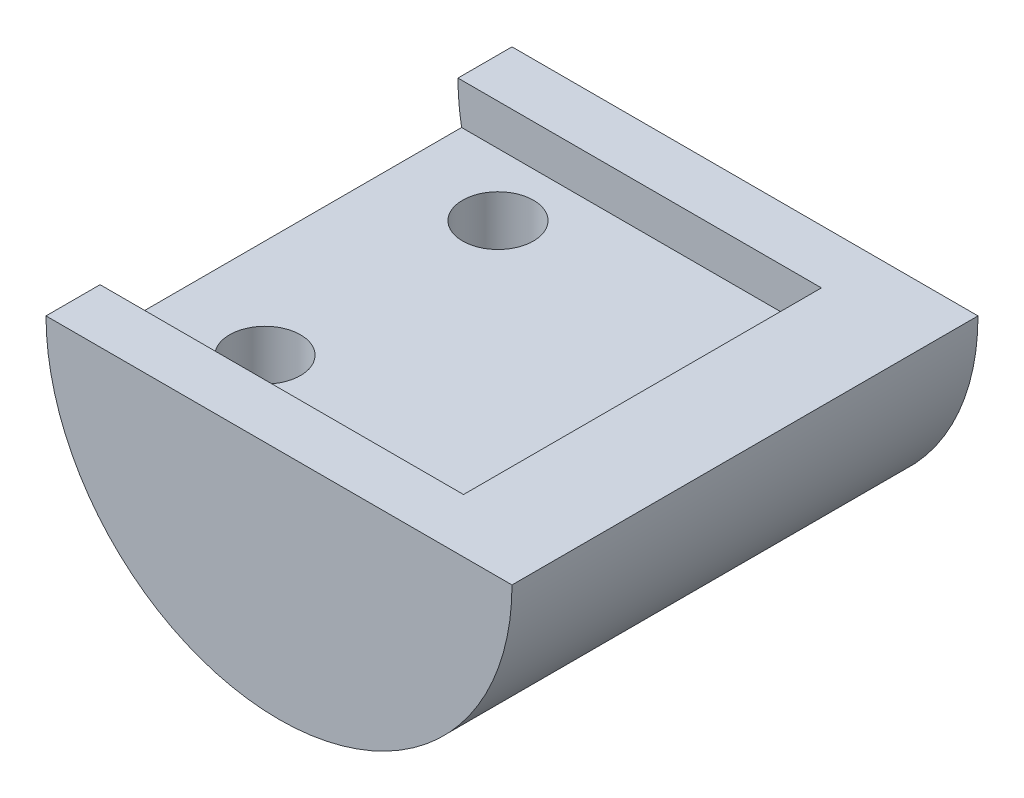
ISO-10303-21;
HEADER;
FILE_DESCRIPTION(('STEP AP214'),'2;1');
FILE_NAME('part.step','',(''),(''),'','','');
FILE_SCHEMA(('AUTOMOTIVE_DESIGN { 1 0 10303 214 1 1 1 1 }'));
ENDSEC;
DATA;
#1=APPLICATION_CONTEXT('core data for automotive mechanical design processes');
#2=APPLICATION_PROTOCOL_DEFINITION('international standard','automotive_design',2000,#1);
#3=PRODUCT_CONTEXT('',#1,'mechanical');
#4=PRODUCT('Part','Part','',(#3));
#5=PRODUCT_RELATED_PRODUCT_CATEGORY('part','',(#4));
#6=PRODUCT_DEFINITION_FORMATION('','',#4);
#7=PRODUCT_DEFINITION_CONTEXT('part definition',#1,'design');
#8=PRODUCT_DEFINITION('design','',#6,#7);
#9=PRODUCT_DEFINITION_SHAPE('','',#8);
#10=(LENGTH_UNIT() NAMED_UNIT(*) SI_UNIT(.MILLI.,.METRE.));
#11=(NAMED_UNIT(*) PLANE_ANGLE_UNIT() SI_UNIT($,.RADIAN.));
#12=(NAMED_UNIT(*) SI_UNIT($,.STERADIAN.) SOLID_ANGLE_UNIT());
#13=UNCERTAINTY_MEASURE_WITH_UNIT(LENGTH_MEASURE(1.E-05),#10,'distance_accuracy_value','');
#14=(GEOMETRIC_REPRESENTATION_CONTEXT(3) GLOBAL_UNCERTAINTY_ASSIGNED_CONTEXT((#13)) GLOBAL_UNIT_ASSIGNED_CONTEXT((#10,
#11,#12)) REPRESENTATION_CONTEXT('',''));
#15=CARTESIAN_POINT('',(0.,0.,0.));
#16=DIRECTION('',(0.,0.,1.));
#17=DIRECTION('',(1.,0.,0.));
#18=AXIS2_PLACEMENT_3D('',#15,#16,#17);
#19=CARTESIAN_POINT('',(0.,0.,-15.875));
#20=DIRECTION('',(0.,0.,1.));
#21=DIRECTION('',(1.,0.,0.));
#22=AXIS2_PLACEMENT_3D('',#19,#20,#21);
#23=CYLINDRICAL_SURFACE('',#22,15.875);
#24=CARTESIAN_POINT('',(-8.89,-13.1523201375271,-5.5245));
#25=CARTESIAN_POINT('',(-9.05972872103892,-13.0375901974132,-5.52450107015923));
#26=CARTESIAN_POINT('',(-9.22727176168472,-12.9195123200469,-5.54240014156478));
#27=CARTESIAN_POINT('',(-9.55334468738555,-12.6803108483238,-5.61147256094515));
#28=CARTESIAN_POINT('',(-9.71185841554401,-12.5591823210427,-5.66270363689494));
#29=CARTESIAN_POINT('',(-10.0143117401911,-12.3193368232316,-5.79611020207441));
#30=CARTESIAN_POINT('',(-10.1583841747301,-12.2006078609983,-5.87796282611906));
#31=CARTESIAN_POINT('',(-10.4298675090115,-11.9693402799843,-6.07224436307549));
#32=CARTESIAN_POINT('',(-10.5573071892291,-11.8567911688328,-6.18461939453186));
#33=CARTESIAN_POINT('',(-10.7530654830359,-11.678988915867,-6.39951330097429));
#34=CARTESIAN_POINT('',(-10.8272630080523,-11.6101150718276,-6.493706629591));
#35=CARTESIAN_POINT('',(-10.9630676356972,-11.4819612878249,-6.69661009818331));
#36=CARTESIAN_POINT('',(-11.0246956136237,-11.4226654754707,-6.80529566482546));
#37=CARTESIAN_POINT('',(-11.1207475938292,-11.3290833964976,-7.01205863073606));
#38=CARTESIAN_POINT('',(-11.1581678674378,-11.2921600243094,-7.10753639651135));
#39=CARTESIAN_POINT('',(-11.2211762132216,-11.2295508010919,-7.30585145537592));
#40=CARTESIAN_POINT('',(-11.2467738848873,-11.2038558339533,-7.40868269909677));
#41=CARTESIAN_POINT('',(-11.2844602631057,-11.1659002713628,-7.62011964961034));
#42=CARTESIAN_POINT('',(-11.296444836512,-11.1537432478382,-7.72876329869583));
#43=CARTESIAN_POINT('',(-11.305452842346,-11.144613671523,-7.94729251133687));
#44=CARTESIAN_POINT('',(-11.3024834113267,-11.1476338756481,-8.05717745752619));
#45=CARTESIAN_POINT('',(-11.2831215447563,-11.1672257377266,-8.2612130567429));
#46=CARTESIAN_POINT('',(-11.2683560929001,-11.1821545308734,-8.35568907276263));
#47=CARTESIAN_POINT('',(-11.2284415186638,-11.2222333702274,-8.54014210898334));
#48=CARTESIAN_POINT('',(-11.2032877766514,-11.2473879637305,-8.63011710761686));
#49=CARTESIAN_POINT('',(-11.1341284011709,-11.3159121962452,-8.83269477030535));
#50=CARTESIAN_POINT('',(-11.0866428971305,-11.3625520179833,-8.94299874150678));
#51=CARTESIAN_POINT('',(-10.9787373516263,-11.4668477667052,-9.15141387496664));
#52=CARTESIAN_POINT('',(-10.918290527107,-11.5245264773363,-9.2494991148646));
#53=CARTESIAN_POINT('',(-10.7642260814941,-11.6688325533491,-9.46489709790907));
#54=CARTESIAN_POINT('',(-10.6663734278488,-11.7585639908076,-9.57708875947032));
#55=CARTESIAN_POINT('',(-10.4562025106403,-11.9458509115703,-9.77892577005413));
#56=CARTESIAN_POINT('',(-10.3438713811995,-12.0434133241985,-9.86855085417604));
#57=CARTESIAN_POINT('',(-10.1050171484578,-12.2445563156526,-10.027309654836));
#58=CARTESIAN_POINT('',(-9.9782321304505,-12.3482228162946,-10.0959383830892));
#59=CARTESIAN_POINT('',(-9.71507202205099,-12.5563203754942,-10.2095856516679));
#60=CARTESIAN_POINT('',(-9.57869442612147,-12.6607516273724,-10.2545979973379));
#61=CARTESIAN_POINT('',(-9.27611959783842,-12.8844876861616,-10.3252491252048));
#62=CARTESIAN_POINT('',(-9.10865922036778,-13.0034764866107,-10.3465953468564));
#63=CARTESIAN_POINT('',(-8.76865180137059,-13.2351258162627,-10.3534234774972));
#64=CARTESIAN_POINT('',(-8.59610872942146,-13.3477910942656,-10.3389326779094));
#65=CARTESIAN_POINT('',(-8.28815650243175,-13.5406044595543,-10.2783521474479));
#66=CARTESIAN_POINT('',(-8.15250199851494,-13.6226361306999,-10.2394766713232));
#67=CARTESIAN_POINT('',(-7.88613892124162,-13.7785408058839,-10.136405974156));
#68=CARTESIAN_POINT('',(-7.75542777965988,-13.8524180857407,-10.0722241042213));
#69=CARTESIAN_POINT('',(-7.50320595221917,-13.9906528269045,-9.91774722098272));
#70=CARTESIAN_POINT('',(-7.38176298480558,-14.0549429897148,-9.82727965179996));
#71=CARTESIAN_POINT('',(-7.15513317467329,-14.1716605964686,-9.62159129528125));
#72=CARTESIAN_POINT('',(-7.04993601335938,-14.224095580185,-9.50638633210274));
#73=CARTESIAN_POINT('',(-6.87355094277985,-14.3100797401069,-9.26998423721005));
#74=CARTESIAN_POINT('',(-6.79976924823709,-14.345160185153,-9.15127630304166));
#75=CARTESIAN_POINT('',(-6.673145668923,-14.4045017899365,-8.90071569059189));
#76=CARTESIAN_POINT('',(-6.62028991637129,-14.4287701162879,-8.76887179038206));
#77=CARTESIAN_POINT('',(-6.54222971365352,-14.4643189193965,-8.50945568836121));
#78=CARTESIAN_POINT('',(-6.51487850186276,-14.4766127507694,-8.38266392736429));
#79=CARTESIAN_POINT('',(-6.48087587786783,-14.4918678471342,-8.12579471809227));
#80=CARTESIAN_POINT('',(-6.47421801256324,-14.4948320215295,-7.99571830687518));
#81=CARTESIAN_POINT('',(-6.48174387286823,-14.4914673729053,-7.74159014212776));
#82=CARTESIAN_POINT('',(-6.49509491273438,-14.4855098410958,-7.61750764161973));
#83=CARTESIAN_POINT('',(-6.54054473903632,-14.4650445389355,-7.37356878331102));
#84=CARTESIAN_POINT('',(-6.57264224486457,-14.4505373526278,-7.25371213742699));
#85=CARTESIAN_POINT('',(-6.65430437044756,-14.4131142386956,-7.02129382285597));
#86=CARTESIAN_POINT('',(-6.70389779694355,-14.3901844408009,-6.90874454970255));
#87=CARTESIAN_POINT('',(-6.81853024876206,-14.3362222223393,-6.69395330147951));
#88=CARTESIAN_POINT('',(-6.88357084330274,-14.3051889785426,-6.59171237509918));
#89=CARTESIAN_POINT('',(-7.02947694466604,-14.2340753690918,-6.39590487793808));
#90=CARTESIAN_POINT('',(-7.11086840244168,-14.1936846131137,-6.3028441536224));
#91=CARTESIAN_POINT('',(-7.28464477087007,-14.1052853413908,-6.1318760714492));
#92=CARTESIAN_POINT('',(-7.37703299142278,-14.0572745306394,-6.05397329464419));
#93=CARTESIAN_POINT('',(-7.57759878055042,-13.9502523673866,-5.90852577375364));
#94=CARTESIAN_POINT('',(-7.68644933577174,-13.8906641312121,-5.84233715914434));
#95=CARTESIAN_POINT('',(-7.90988133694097,-13.7646603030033,-5.72895928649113));
#96=CARTESIAN_POINT('',(-8.02446449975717,-13.6982426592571,-5.6817757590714));
#97=CARTESIAN_POINT('',(-8.26424018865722,-13.5550265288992,-5.60341120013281));
#98=CARTESIAN_POINT('',(-8.38962199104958,-13.4778286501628,-5.57354690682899));
#99=CARTESIAN_POINT('',(-8.64039278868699,-13.3184602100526,-5.53408503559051));
#100=CARTESIAN_POINT('',(-8.76578174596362,-13.2362867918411,-5.52449921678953));
#101=CARTESIAN_POINT('',(-8.89,-13.1523201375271,-5.5245));
#102=B_SPLINE_CURVE_WITH_KNOTS('',3,(#24,#25,#26,#27,#28,#29,#30,#31,#32,#33,#34,#35,#36,#37,
#38,#39,#40,#41,#42,#43,#44,#45,#46,#47,#48,#49,#50,#51,#52,#53,#54,#55,#56,#57,#58,#59,#60,#61,
#62,#63,#64,#65,#66,#67,#68,#69,#70,#71,#72,#73,#74,#75,#76,#77,#78,#79,#80,#81,#82,#83,#84,#85,
#86,#87,#88,#89,#90,#91,#92,#93,#94,#95,#96,#97,#98,#99,#100,#101),.UNSPECIFIED.,.T.,.F.,(4,2,2,
2,2,2,2,2,2,2,2,2,2,2,2,2,2,2,2,2,2,2,2,2,2,2,2,2,2,2,2,2,2,2,2,2,2,2,4),(0.,0.614029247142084,
1.22912477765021,1.83790976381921,2.44562696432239,2.85914598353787,3.27197254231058,
3.59770245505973,3.923167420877,4.2511056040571,4.57888729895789,4.86795077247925,
5.15714293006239,5.5415125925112,5.92668429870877,6.44537390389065,6.9645276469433,
7.49533185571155,8.02627522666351,8.64280473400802,9.25886487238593,9.746543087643,
10.2339643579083,10.7246605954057,11.2150438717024,11.6449783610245,12.0746274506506,
12.4635352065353,12.8523216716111,13.2253714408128,13.5983957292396,13.972037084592,
14.3457164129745,14.7342382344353,15.1228772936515,15.5430976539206,15.9634446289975,
16.4125698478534,16.8619554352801),.UNSPECIFIED.);
#103=CARTESIAN_POINT('',(-8.89,-13.1523201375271,-5.5245));
#104=VERTEX_POINT('',#103);
#105=EDGE_CURVE('E131',#104,#104,#102,.T.);
#106=ORIENTED_EDGE('',*,*,#105,.F.);
#107=EDGE_LOOP('',(#106));
#108=FACE_BOUND('',#107,.T.);
#109=CARTESIAN_POINT('',(-8.89,-13.1523201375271,10.3505));
#110=CARTESIAN_POINT('',(-9.05972872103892,-13.0375901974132,10.3504989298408));
#111=CARTESIAN_POINT('',(-9.22727176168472,-12.9195123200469,10.3325998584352));
#112=CARTESIAN_POINT('',(-9.55334468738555,-12.6803108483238,10.2635274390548));
#113=CARTESIAN_POINT('',(-9.71185841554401,-12.5591823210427,10.2122963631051));
#114=CARTESIAN_POINT('',(-10.0143117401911,-12.3193368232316,10.0788897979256));
#115=CARTESIAN_POINT('',(-10.1583841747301,-12.2006078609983,9.99703717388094));
#116=CARTESIAN_POINT('',(-10.4298675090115,-11.9693402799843,9.80275563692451));
#117=CARTESIAN_POINT('',(-10.5573071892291,-11.8567911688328,9.69038060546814));
#118=CARTESIAN_POINT('',(-10.7530654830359,-11.678988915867,9.47548669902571));
#119=CARTESIAN_POINT('',(-10.8272630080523,-11.6101150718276,9.38129337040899));
#120=CARTESIAN_POINT('',(-10.9630676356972,-11.4819612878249,9.17838990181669));
#121=CARTESIAN_POINT('',(-11.0246956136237,-11.4226654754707,9.06970433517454));
#122=CARTESIAN_POINT('',(-11.1207475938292,-11.3290833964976,8.86294136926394));
#123=CARTESIAN_POINT('',(-11.1581678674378,-11.2921600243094,8.76746360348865));
#124=CARTESIAN_POINT('',(-11.2211762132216,-11.229550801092,8.56914854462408));
#125=CARTESIAN_POINT('',(-11.2467738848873,-11.2038558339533,8.46631730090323));
#126=CARTESIAN_POINT('',(-11.2844602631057,-11.1659002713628,8.25488035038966));
#127=CARTESIAN_POINT('',(-11.296444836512,-11.1537432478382,8.14623670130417));
#128=CARTESIAN_POINT('',(-11.305452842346,-11.144613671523,7.92770748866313));
#129=CARTESIAN_POINT('',(-11.3024834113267,-11.1476338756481,7.8178225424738));
#130=CARTESIAN_POINT('',(-11.2831215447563,-11.1672257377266,7.6137869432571));
#131=CARTESIAN_POINT('',(-11.2683560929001,-11.1821545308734,7.51931092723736));
#132=CARTESIAN_POINT('',(-11.2284415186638,-11.2222333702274,7.33485789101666));
#133=CARTESIAN_POINT('',(-11.2032877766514,-11.2473879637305,7.24488289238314));
#134=CARTESIAN_POINT('',(-11.1341284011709,-11.3159121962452,7.04230522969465));
#135=CARTESIAN_POINT('',(-11.0866428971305,-11.3625520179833,6.93200125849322));
#136=CARTESIAN_POINT('',(-10.9787373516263,-11.4668477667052,6.72358612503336));
#137=CARTESIAN_POINT('',(-10.918290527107,-11.5245264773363,6.6255008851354));
#138=CARTESIAN_POINT('',(-10.7642260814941,-11.668832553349,6.41010290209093));
#139=CARTESIAN_POINT('',(-10.6663734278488,-11.7585639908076,6.29791124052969));
#140=CARTESIAN_POINT('',(-10.4562025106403,-11.9458509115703,6.09607422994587));
#141=CARTESIAN_POINT('',(-10.3438713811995,-12.0434133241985,6.00644914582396));
#142=CARTESIAN_POINT('',(-10.1050171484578,-12.2445563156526,5.84769034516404));
#143=CARTESIAN_POINT('',(-9.9782321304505,-12.3482228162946,5.7790616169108));
#144=CARTESIAN_POINT('',(-9.71507202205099,-12.5563203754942,5.66541434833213));
#145=CARTESIAN_POINT('',(-9.57869442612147,-12.6607516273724,5.62040200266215));
#146=CARTESIAN_POINT('',(-9.27611959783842,-12.8844876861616,5.54975087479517));
#147=CARTESIAN_POINT('',(-9.10865922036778,-13.0034764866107,5.52840465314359));
#148=CARTESIAN_POINT('',(-8.76865180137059,-13.2351258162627,5.52157652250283));
#149=CARTESIAN_POINT('',(-8.59610872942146,-13.3477910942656,5.53606732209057));
#150=CARTESIAN_POINT('',(-8.28815650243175,-13.5406044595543,5.59664785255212));
#151=CARTESIAN_POINT('',(-8.15250199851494,-13.6226361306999,5.63552332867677));
#152=CARTESIAN_POINT('',(-7.88613892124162,-13.7785408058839,5.73859402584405));
#153=CARTESIAN_POINT('',(-7.75542777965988,-13.8524180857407,5.80277589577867));
#154=CARTESIAN_POINT('',(-7.50320595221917,-13.9906528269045,5.95725277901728));
#155=CARTESIAN_POINT('',(-7.38176298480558,-14.0549429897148,6.04772034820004));
#156=CARTESIAN_POINT('',(-7.15513317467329,-14.1716605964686,6.25340870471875));
#157=CARTESIAN_POINT('',(-7.04993601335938,-14.224095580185,6.36861366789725));
#158=CARTESIAN_POINT('',(-6.87355094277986,-14.3100797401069,6.60501576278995));
#159=CARTESIAN_POINT('',(-6.7997692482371,-14.345160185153,6.72372369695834));
#160=CARTESIAN_POINT('',(-6.673145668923,-14.4045017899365,6.97428430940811));
#161=CARTESIAN_POINT('',(-6.62028991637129,-14.4287701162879,7.10612820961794));
#162=CARTESIAN_POINT('',(-6.54222971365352,-14.4643189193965,7.36554431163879));
#163=CARTESIAN_POINT('',(-6.51487850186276,-14.4766127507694,7.49233607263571));
#164=CARTESIAN_POINT('',(-6.48087587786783,-14.4918678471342,7.74920528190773));
#165=CARTESIAN_POINT('',(-6.47421801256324,-14.4948320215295,7.87928169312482));
#166=CARTESIAN_POINT('',(-6.48174387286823,-14.4914673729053,8.13340985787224));
#167=CARTESIAN_POINT('',(-6.49509491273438,-14.4855098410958,8.25749235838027));
#168=CARTESIAN_POINT('',(-6.54054473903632,-14.4650445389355,8.50143121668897));
#169=CARTESIAN_POINT('',(-6.57264224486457,-14.4505373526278,8.62128786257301));
#170=CARTESIAN_POINT('',(-6.65430437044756,-14.4131142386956,8.85370617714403));
#171=CARTESIAN_POINT('',(-6.70389779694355,-14.3901844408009,8.96625545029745));
#172=CARTESIAN_POINT('',(-6.81853024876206,-14.3362222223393,9.18104669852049));
#173=CARTESIAN_POINT('',(-6.88357084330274,-14.3051889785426,9.28328762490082));
#174=CARTESIAN_POINT('',(-7.02947694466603,-14.2340753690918,9.47909512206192));
#175=CARTESIAN_POINT('',(-7.11086840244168,-14.1936846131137,9.57215584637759));
#176=CARTESIAN_POINT('',(-7.28464477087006,-14.1052853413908,9.7431239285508));
#177=CARTESIAN_POINT('',(-7.37703299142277,-14.0572745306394,9.82102670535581));
#178=CARTESIAN_POINT('',(-7.57759878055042,-13.9502523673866,9.96647422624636));
#179=CARTESIAN_POINT('',(-7.68644933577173,-13.8906641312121,10.0326628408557));
#180=CARTESIAN_POINT('',(-7.90988133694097,-13.7646603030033,10.1460407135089));
#181=CARTESIAN_POINT('',(-8.02446449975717,-13.6982426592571,10.1932242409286));
#182=CARTESIAN_POINT('',(-8.26424018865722,-13.5550265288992,10.2715887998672));
#183=CARTESIAN_POINT('',(-8.38962199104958,-13.4778286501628,10.301453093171));
#184=CARTESIAN_POINT('',(-8.64039278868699,-13.3184602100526,10.3409149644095));
#185=CARTESIAN_POINT('',(-8.76578174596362,-13.2362867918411,10.3505007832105));
#186=CARTESIAN_POINT('',(-8.89,-13.1523201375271,10.3505));
#187=B_SPLINE_CURVE_WITH_KNOTS('',3,(#109,#110,#111,#112,#113,#114,#115,#116,#117,#118,#119,
#120,#121,#122,#123,#124,#125,#126,#127,#128,#129,#130,#131,#132,#133,#134,#135,#136,#137,#138,
#139,#140,#141,#142,#143,#144,#145,#146,#147,#148,#149,#150,#151,#152,#153,#154,#155,#156,#157,
#158,#159,#160,#161,#162,#163,#164,#165,#166,#167,#168,#169,#170,#171,#172,#173,#174,#175,#176,
#177,#178,#179,#180,#181,#182,#183,#184,#185,#186),.UNSPECIFIED.,.T.,.F.,(4,2,2,2,2,2,2,2,2,2,2,
2,2,2,2,2,2,2,2,2,2,2,2,2,2,2,2,2,2,2,2,2,2,2,2,2,2,2,4),(0.,0.614029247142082,1.22912477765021,
1.83790976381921,2.44562696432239,2.85914598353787,3.27197254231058,3.59770245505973,
3.923167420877,4.2511056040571,4.57888729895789,4.86795077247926,5.15714293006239,
5.5415125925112,5.92668429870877,6.44537390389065,6.9645276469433,7.49533185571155,
8.02627522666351,8.64280473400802,9.25886487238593,9.746543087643,10.2339643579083,
10.7246605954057,11.2150438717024,11.6449783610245,12.0746274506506,12.4635352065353,
12.8523216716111,13.2253714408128,13.5983957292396,13.972037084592,14.3457164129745,
14.7342382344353,15.1228772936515,15.5430976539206,15.9634446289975,16.4125698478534,
16.8619554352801),.UNSPECIFIED.);
#188=CARTESIAN_POINT('',(-8.89,-13.1523201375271,10.3505));
#189=VERTEX_POINT('',#188);
#190=EDGE_CURVE('E160',#189,#189,#187,.T.);
#191=ORIENTED_EDGE('',*,*,#190,.F.);
#192=EDGE_LOOP('',(#191));
#193=FACE_BOUND('',#192,.T.);
#194=DIRECTION('',(0.,0.,1.));
#195=VECTOR('',#194,1.);
#196=CARTESIAN_POINT('',(-15.875,0.,-15.875));
#197=LINE('',#196,#195);
#198=CARTESIAN_POINT('',(-15.875,0.,12.192));
#199=VERTEX_POINT('',#198);
#200=CARTESIAN_POINT('',(-15.875,0.,15.875));
#201=VERTEX_POINT('',#200);
#202=EDGE_CURVE('E155',#199,#201,#197,.T.);
#203=ORIENTED_EDGE('',*,*,#202,.F.);
#204=CARTESIAN_POINT('',(0.,0.,12.192));
#205=DIRECTION('',(0.,0.,-1.));
#206=DIRECTION('',(0.,1.,0.));
#207=AXIS2_PLACEMENT_3D('',#204,#205,#206);
#208=CIRCLE('',#207,15.875);
#209=CARTESIAN_POINT('',(-15.6271938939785,-2.794,12.192));
#210=VERTEX_POINT('',#209);
#211=EDGE_CURVE('E134',#199,#210,#208,.F.);
#212=ORIENTED_EDGE('',*,*,#211,.T.);
#213=DIRECTION('',(0.,0.,1.));
#214=VECTOR('',#213,1.);
#215=CARTESIAN_POINT('',(-15.6271938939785,-2.794,-15.875));
#216=LINE('',#215,#214);
#217=CARTESIAN_POINT('',(-15.6271938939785,-2.794,-12.192));
#218=VERTEX_POINT('',#217);
#219=EDGE_CURVE('E12',#210,#218,#216,.F.);
#220=ORIENTED_EDGE('',*,*,#219,.T.);
#221=CARTESIAN_POINT('',(0.,0.,-12.192));
#222=DIRECTION('',(0.,0.,1.));
#223=DIRECTION('',(0.,-1.,0.));
#224=AXIS2_PLACEMENT_3D('',#221,#222,#223);
#225=CIRCLE('',#224,15.875);
#226=CARTESIAN_POINT('',(-15.875,0.,-12.192));
#227=VERTEX_POINT('',#226);
#228=EDGE_CURVE('E116',#218,#227,#225,.F.);
#229=ORIENTED_EDGE('',*,*,#228,.T.);
#230=CARTESIAN_POINT('',(-15.875,0.,-15.875));
#231=VERTEX_POINT('',#230);
#232=EDGE_CURVE('E54',#231,#227,#197,.T.);
#233=ORIENTED_EDGE('',*,*,#232,.F.);
#234=CARTESIAN_POINT('',(0.,0.,-15.875));
#235=DIRECTION('',(0.,0.,1.));
#236=DIRECTION('',(1.,0.,0.));
#237=AXIS2_PLACEMENT_3D('',#234,#235,#236);
#238=CIRCLE('',#237,15.875);
#239=CARTESIAN_POINT('',(15.875,0.,-15.875));
#240=VERTEX_POINT('',#239);
#241=EDGE_CURVE('E146',#231,#240,#238,.T.);
#242=ORIENTED_EDGE('',*,*,#241,.T.);
#243=DIRECTION('',(0.,0.,1.));
#244=VECTOR('',#243,1.);
#245=CARTESIAN_POINT('',(15.875,0.,-15.875));
#246=LINE('',#245,#244);
#247=CARTESIAN_POINT('',(15.875,0.,15.875));
#248=VERTEX_POINT('',#247);
#249=EDGE_CURVE('E152',#240,#248,#246,.T.);
#250=ORIENTED_EDGE('',*,*,#249,.T.);
#251=CARTESIAN_POINT('',(0.,0.,15.875));
#252=DIRECTION('',(0.,0.,1.));
#253=DIRECTION('',(1.,0.,0.));
#254=AXIS2_PLACEMENT_3D('',#251,#252,#253);
#255=CIRCLE('',#254,15.875);
#256=EDGE_CURVE('E138',#201,#248,#255,.T.);
#257=ORIENTED_EDGE('',*,*,#256,.F.);
#258=EDGE_LOOP('',(#203,#212,#220,#229,#233,#242,#250,#257));
#259=FACE_BOUND('',#258,.T.);
#260=ADVANCED_FACE('F44',(#108,#193,#259),#23,.T.);
#261=CARTESIAN_POINT('',(-15.875,0.,-15.875));
#262=DIRECTION('',(0.,1.,0.));
#263=DIRECTION('',(0.,0.,1.));
#264=AXIS2_PLACEMENT_3D('',#261,#262,#263);
#265=PLANE('',#264);
#266=DIRECTION('',(0.,0.,1.));
#267=VECTOR('',#266,1.);
#268=CARTESIAN_POINT('',(8.89,0.,12.192));
#269=LINE('',#268,#267);
#270=CARTESIAN_POINT('',(8.89,0.,-12.192));
#271=VERTEX_POINT('',#270);
#272=CARTESIAN_POINT('',(8.89,0.,12.192));
#273=VERTEX_POINT('',#272);
#274=EDGE_CURVE('E99',#271,#273,#269,.T.);
#275=ORIENTED_EDGE('',*,*,#274,.T.);
#276=DIRECTION('',(-1.,0.,0.));
#277=VECTOR('',#276,1.);
#278=CARTESIAN_POINT('',(42.3235509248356,0.,12.192));
#279=LINE('',#278,#277);
#280=EDGE_CURVE('E128',#273,#199,#279,.T.);
#281=ORIENTED_EDGE('',*,*,#280,.T.);
#282=ORIENTED_EDGE('',*,*,#202,.T.);
#283=DIRECTION('',(-1.,0.,0.));
#284=VECTOR('',#283,1.);
#285=CARTESIAN_POINT('',(-15.875,0.,15.875));
#286=LINE('',#285,#284);
#287=EDGE_CURVE('E142',#248,#201,#286,.T.);
#288=ORIENTED_EDGE('',*,*,#287,.F.);
#289=ORIENTED_EDGE('',*,*,#249,.F.);
#290=DIRECTION('',(-1.,0.,0.));
#291=VECTOR('',#290,1.);
#292=CARTESIAN_POINT('',(-15.875,0.,-15.875));
#293=LINE('',#292,#291);
#294=EDGE_CURVE('E149',#240,#231,#293,.T.);
#295=ORIENTED_EDGE('',*,*,#294,.T.);
#296=ORIENTED_EDGE('',*,*,#232,.T.);
#297=DIRECTION('',(-1.,0.,0.));
#298=VECTOR('',#297,1.);
#299=CARTESIAN_POINT('',(42.3235509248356,0.,-12.192));
#300=LINE('',#299,#298);
#301=EDGE_CURVE('E108',#271,#227,#300,.T.);
#302=ORIENTED_EDGE('',*,*,#301,.F.);
#303=EDGE_LOOP('',(#275,#281,#282,#288,#289,#295,#296,#302));
#304=FACE_BOUND('',#303,.T.);
#305=ADVANCED_FACE('F119',(#304),#265,.T.);
#306=CARTESIAN_POINT('',(0.,0.,-15.875));
#307=DIRECTION('',(0.,0.,1.));
#308=DIRECTION('',(1.,0.,0.));
#309=AXIS2_PLACEMENT_3D('',#306,#307,#308);
#310=PLANE('',#309);
#311=ORIENTED_EDGE('',*,*,#241,.F.);
#312=ORIENTED_EDGE('',*,*,#294,.F.);
#313=EDGE_LOOP('',(#311,#312));
#314=FACE_BOUND('',#313,.T.);
#315=ADVANCED_FACE('F200',(#314),#310,.F.);
#316=CARTESIAN_POINT('',(0.,0.,15.875));
#317=DIRECTION('',(0.,0.,1.));
#318=DIRECTION('',(1.,0.,0.));
#319=AXIS2_PLACEMENT_3D('',#316,#317,#318);
#320=PLANE('',#319);
#321=ORIENTED_EDGE('',*,*,#256,.T.);
#322=ORIENTED_EDGE('',*,*,#287,.T.);
#323=EDGE_LOOP('',(#321,#322));
#324=FACE_BOUND('',#323,.T.);
#325=ADVANCED_FACE('F194',(#324),#320,.T.);
#326=CARTESIAN_POINT('',(42.3235509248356,0.,12.192));
#327=DIRECTION('',(0.,0.,-1.));
#328=DIRECTION('',(0.,1.,0.));
#329=AXIS2_PLACEMENT_3D('',#326,#327,#328);
#330=PLANE('',#329);
#331=ORIENTED_EDGE('',*,*,#280,.F.);
#332=DIRECTION('',(0.,-1.,0.));
#333=VECTOR('',#332,1.);
#334=CARTESIAN_POINT('',(8.89,0.,12.192));
#335=LINE('',#334,#333);
#336=CARTESIAN_POINT('',(8.89,-2.794,12.192));
#337=VERTEX_POINT('',#336);
#338=EDGE_CURVE('E62',#273,#337,#335,.T.);
#339=ORIENTED_EDGE('',*,*,#338,.T.);
#340=DIRECTION('',(-1.,0.,0.));
#341=VECTOR('',#340,1.);
#342=CARTESIAN_POINT('',(42.3235509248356,-2.794,12.192));
#343=LINE('',#342,#341);
#344=EDGE_CURVE('E124',#337,#210,#343,.T.);
#345=ORIENTED_EDGE('',*,*,#344,.T.);
#346=ORIENTED_EDGE('',*,*,#211,.F.);
#347=EDGE_LOOP('',(#331,#339,#345,#346));
#348=FACE_BOUND('',#347,.T.);
#349=ADVANCED_FACE('F190',(#348),#330,.T.);
#350=CARTESIAN_POINT('',(42.3235509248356,-2.794,12.192));
#351=DIRECTION('',(0.,1.,0.));
#352=DIRECTION('',(0.,0.,1.));
#353=AXIS2_PLACEMENT_3D('',#350,#351,#352);
#354=PLANE('',#353);
#355=CARTESIAN_POINT('',(-8.89,-2.794,-7.9375));
#356=DIRECTION('',(0.,1.,0.));
#357=DIRECTION('',(0.,0.,1.));
#358=AXIS2_PLACEMENT_3D('',#355,#356,#357);
#359=CIRCLE('',#358,2.413);
#360=CARTESIAN_POINT('',(-8.89,-2.794,-5.5245));
#361=VERTEX_POINT('',#360);
#362=EDGE_CURVE('E48',#361,#361,#359,.T.);
#363=ORIENTED_EDGE('',*,*,#362,.F.);
#364=EDGE_LOOP('',(#363));
#365=FACE_BOUND('',#364,.T.);
#366=CARTESIAN_POINT('',(-8.89,-2.794,7.9375));
#367=DIRECTION('',(0.,1.,0.));
#368=DIRECTION('',(0.,0.,1.));
#369=AXIS2_PLACEMENT_3D('',#366,#367,#368);
#370=CIRCLE('',#369,2.413);
#371=CARTESIAN_POINT('',(-8.89,-2.794,10.3505));
#372=VERTEX_POINT('',#371);
#373=EDGE_CURVE('E157',#372,#372,#370,.T.);
#374=ORIENTED_EDGE('',*,*,#373,.F.);
#375=EDGE_LOOP('',(#374));
#376=FACE_BOUND('',#375,.T.);
#377=ORIENTED_EDGE('',*,*,#344,.F.);
#378=DIRECTION('',(0.,0.,-1.));
#379=VECTOR('',#378,1.);
#380=CARTESIAN_POINT('',(8.89,-2.794,12.192));
#381=LINE('',#380,#379);
#382=CARTESIAN_POINT('',(8.89,-2.794,-12.192));
#383=VERTEX_POINT('',#382);
#384=EDGE_CURVE('E117',#337,#383,#381,.T.);
#385=ORIENTED_EDGE('',*,*,#384,.T.);
#386=DIRECTION('',(-1.,0.,0.));
#387=VECTOR('',#386,1.);
#388=CARTESIAN_POINT('',(42.3235509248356,-2.794,-12.192));
#389=LINE('',#388,#387);
#390=EDGE_CURVE('E113',#383,#218,#389,.T.);
#391=ORIENTED_EDGE('',*,*,#390,.T.);
#392=ORIENTED_EDGE('',*,*,#219,.F.);
#393=EDGE_LOOP('',(#377,#385,#391,#392));
#394=FACE_BOUND('',#393,.T.);
#395=ADVANCED_FACE('F187',(#365,#376,#394),#354,.T.);
#396=CARTESIAN_POINT('',(42.3235509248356,0.,-12.192));
#397=DIRECTION('',(0.,0.,1.));
#398=DIRECTION('',(0.,-1.,0.));
#399=AXIS2_PLACEMENT_3D('',#396,#397,#398);
#400=PLANE('',#399);
#401=ORIENTED_EDGE('',*,*,#390,.F.);
#402=DIRECTION('',(0.,1.,0.));
#403=VECTOR('',#402,1.);
#404=CARTESIAN_POINT('',(8.89,0.,-12.192));
#405=LINE('',#404,#403);
#406=EDGE_CURVE('E102',#383,#271,#405,.T.);
#407=ORIENTED_EDGE('',*,*,#406,.T.);
#408=ORIENTED_EDGE('',*,*,#301,.T.);
#409=ORIENTED_EDGE('',*,*,#228,.F.);
#410=EDGE_LOOP('',(#401,#407,#408,#409));
#411=FACE_BOUND('',#410,.T.);
#412=ADVANCED_FACE('F111',(#411),#400,.T.);
#413=CARTESIAN_POINT('',(8.89,0.,0.));
#414=DIRECTION('',(1.,0.,0.));
#415=DIRECTION('',(0.,0.,-1.));
#416=AXIS2_PLACEMENT_3D('',#413,#414,#415);
#417=PLANE('',#416);
#418=ORIENTED_EDGE('',*,*,#274,.F.);
#419=ORIENTED_EDGE('',*,*,#406,.F.);
#420=ORIENTED_EDGE('',*,*,#384,.F.);
#421=ORIENTED_EDGE('',*,*,#338,.F.);
#422=EDGE_LOOP('',(#418,#419,#420,#421));
#423=FACE_BOUND('',#422,.T.);
#424=ADVANCED_FACE('F101',(#423),#417,.F.);
#425=CARTESIAN_POINT('',(-8.89,-15.875,7.9375));
#426=DIRECTION('',(0.,1.,0.));
#427=DIRECTION('',(0.,0.,1.));
#428=AXIS2_PLACEMENT_3D('',#425,#426,#427);
#429=CYLINDRICAL_SURFACE('',#428,2.413);
#430=ORIENTED_EDGE('',*,*,#190,.T.);
#431=EDGE_LOOP('',(#430));
#432=FACE_BOUND('',#431,.T.);
#433=ORIENTED_EDGE('',*,*,#373,.T.);
#434=EDGE_LOOP('',(#433));
#435=FACE_BOUND('',#434,.T.);
#436=ADVANCED_FACE('F179',(#432,#435),#429,.F.);
#437=CARTESIAN_POINT('',(-8.89,-15.875,-7.9375));
#438=DIRECTION('',(0.,1.,0.));
#439=DIRECTION('',(0.,0.,1.));
#440=AXIS2_PLACEMENT_3D('',#437,#438,#439);
#441=CYLINDRICAL_SURFACE('',#440,2.413);
#442=ORIENTED_EDGE('',*,*,#105,.T.);
#443=EDGE_LOOP('',(#442));
#444=FACE_BOUND('',#443,.T.);
#445=ORIENTED_EDGE('',*,*,#362,.T.);
#446=EDGE_LOOP('',(#445));
#447=FACE_BOUND('',#446,.T.);
#448=ADVANCED_FACE('F183',(#444,#447),#441,.F.);
#449=CLOSED_SHELL('',(#260,#305,#315,#325,#349,#395,#412,#424,#436,#448));
#450=MANIFOLD_SOLID_BREP('B2',#449);
#451=ADVANCED_BREP_SHAPE_REPRESENTATION('',(#18,#450),#14);
#452=SHAPE_DEFINITION_REPRESENTATION(#9,#451);
ENDSEC;
END-ISO-10303-21;
